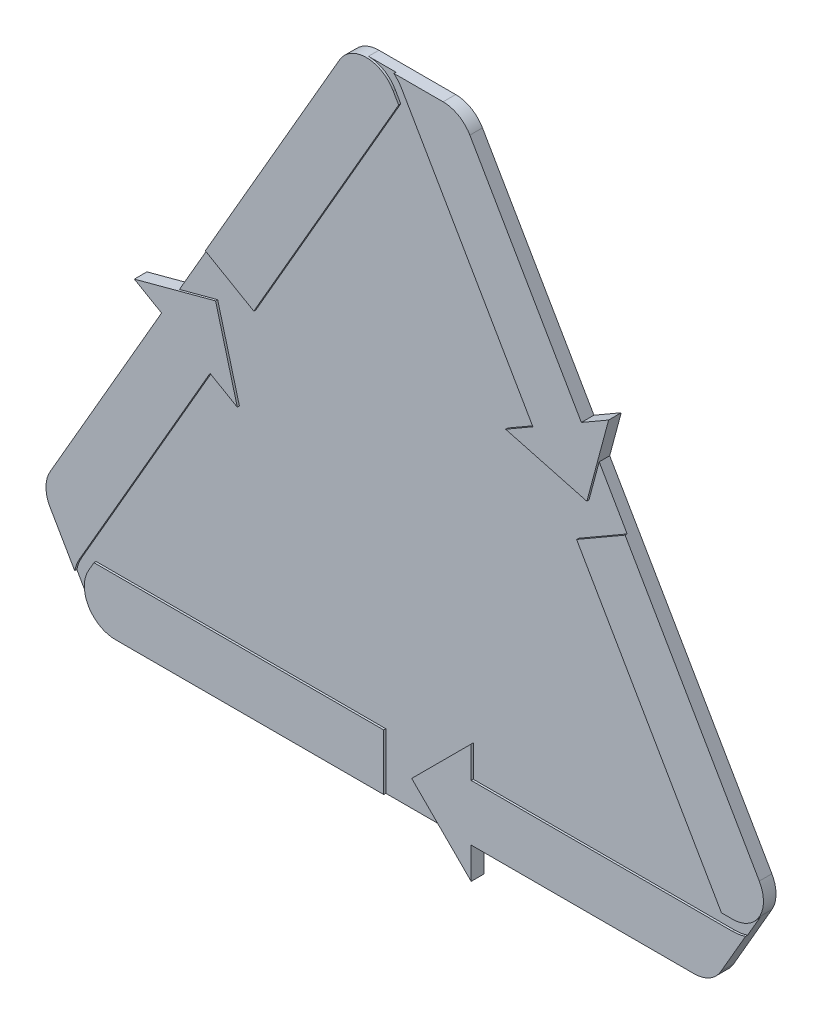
from build123d import *

# Parameters (mm, degrees)
BOSS_EXTRUDE1_DEPTH   = 0.3
BOSS_EXTRUDE1_2_DEPTH = 0.3
CIRPATTERN1_COUNT     = 3
BOSS_EXTRUDE3_START   = -1.5
BOSS_EXTRUDE3_DEPTH   = 1.5
BOSS_EXTRUDE4_DEPTH   = 1.5


with BuildPart() as part:
    # Sketch1 → Boss-Extrude1 (new body)
    with BuildSketch(Plane.XY):
        with BuildLine():
            Line((31.5, 14.722431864), (24.57179677, 10.722431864))
            Line((24.57179677, 10.722431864), (45.277568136, -25.141016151))
            Line((45.277568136, -25.141016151), (46.854227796, -25.141016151))
            ThreePointArc((46.854227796, -25.141016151), (50.684700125, -22.929491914), (50.684700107, -18.506443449))
            Line((50.684700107, -18.506443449), (31.5, 14.722431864))
        make_face()
    extrude(amount=BOSS_EXTRUDE1_DEPTH)


with BuildPart() as body_2:
    # Sketch1 → Boss-Extrude1 2 (new body)
    with BuildSketch(Plane.XY):
        with BuildLine():
            Line((9.5, -22.141016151), (1, -30.641016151))
            Line((1, -30.641016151), (9.5, -39.141016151))
            Line((9.5, -39.141016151), (9.5, -34.641016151))
            Line((9.5, -34.641016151), (41.369400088, -34.641016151))
            ThreePointArc((41.369400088, -34.641016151), (43.580924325, -34.048440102), (45.199872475, -32.429492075))
            Line((45.199872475, -32.429492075), (48.714982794, -26.341142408))
            ThreePointArc((48.714982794, -26.341142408), (47.796609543, -26.565567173), (46.854227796, -26.641016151))
            Line((46.854227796, -26.641016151), (9.5, -26.641016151))
            Line((9.5, -26.641016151), (9.5, -22.141016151))
        make_face()
    extrude(amount=BOSS_EXTRUDE1_2_DEPTH)


with BuildPart() as cirpattern1_1:
    # CirPattern1: pattern copy
    add(part.part.rotate(Axis((0, 0, 0), (0, 0, 1)), 1 * 360 / CIRPATTERN1_COUNT))


with BuildPart() as cirpattern1_2:
    # CirPattern1: pattern copy
    add(part.part.rotate(Axis((0, 0, 0), (0, 0, 1)), 2 * 360 / CIRPATTERN1_COUNT))


with BuildPart() as cirpattern1_3:
    # CirPattern1: pattern copy
    add(body_2.part.rotate(Axis((0, 0, 0), (0, 0, 1)), 1 * 360 / CIRPATTERN1_COUNT))


with BuildPart() as cirpattern1_4:
    # CirPattern1: pattern copy
    add(body_2.part.rotate(Axis((0, 0, 0), (0, 0, 1)), 2 * 360 / CIRPATTERN1_COUNT))


with BuildPart() as part_1:
    add(part.part)

    add(body_2.part)  # Boss-Extrude3 merges body 2

    add(cirpattern1_1.part)  # Boss-Extrude3 merges CirPattern1_1

    add(cirpattern1_2.part)  # Boss-Extrude3 merges CirPattern1_2

    add(cirpattern1_3.part)  # Boss-Extrude3 merges CirPattern1_3

    add(cirpattern1_4.part)  # Boss-Extrude3 merges CirPattern1_4
    # Sketch3 → Boss-Extrude3 (add)
    with BuildSketch(Plane.XY.offset(BOSS_EXTRUDE3_START)):
        with BuildLine():
            Line((45.199872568, -32.429491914), (50.684700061, -22.929492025))
            ThreePointArc((50.684700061, -22.929492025), (51.27727625, -20.717967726), (50.684700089, -18.506443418))
            Line((50.684700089, -18.506443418), (9.315299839, 53.147459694))
            ThreePointArc((9.315299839, 53.147459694), (7.696351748, 54.766407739), (5.484827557, 55.358983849))
            Line((5.484827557, 55.358983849), (-5.484827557, 55.358983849))
            ThreePointArc((-5.484827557, 55.358983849), (-7.696351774, 54.766407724), (-9.315299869, 53.147459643))
            Line((-9.315299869, 53.147459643), (-50.684700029, -18.506443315))
            ThreePointArc((-50.684700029, -18.506443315), (-51.27727625, -20.717968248), (-50.684699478, -22.929493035))
            Line((-50.684699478, -22.929493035), (-45.199871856, -32.429493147))
            ThreePointArc((-45.199871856, -32.429493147), (-43.580923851, -34.048440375), (-41.369400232, -34.641016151))
            Line((-41.369400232, -34.641016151), (41.369400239, -34.641016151))
            ThreePointArc((41.369400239, -34.641016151), (43.580924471, -34.048440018), (45.199872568, -32.429491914))
        make_face()
    extrude(amount=BOSS_EXTRUDE3_DEPTH)

    # Sketch4 → Boss-Extrude4 (add, through all)
    with BuildSketch(Plane.XY):
        with BuildLine():
            Line((1, -30.641016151), (9.5, -39.141016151))
            Line((9.5, -39.141016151), (9.5, -34.641016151))
            Line((9.5, -34.641016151), (41.369400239, -34.641016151))
            ThreePointArc((41.369400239, -34.641016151), (43.580924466, -34.048440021), (45.199872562, -32.429491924))
            Line((45.199872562, -32.429491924), (48.714982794, -26.341142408))
            ThreePointArc((48.714982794, -26.341142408), (47.796609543, -26.565567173), (46.854227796, -26.641016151))
            Line((46.854227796, -26.641016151), (9.5, -26.641016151))
            Line((9.5, -26.641016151), (9.5, -22.141016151))
            Line((9.5, -22.141016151), (1, -30.641016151))
        make_face()
        with BuildLine():
            Line((26.035898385, 16.186533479), (29.147114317, 27.797749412))
            Line((29.147114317, 27.797749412), (25.25, 25.547749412))
            Line((25.25, 25.547749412), (9.315299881, 53.147459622))
            ThreePointArc((9.315299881, 53.147459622), (7.696351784, 54.766407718), (5.484827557, 55.358983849))
            Line((5.484827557, 55.358983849), (-1.545392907, 55.358983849))
            ThreePointArc((-1.545392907, 55.358983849), (-0.891848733, 54.675861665), (-0.355317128, 53.897459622))
            Line((-0.355317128, 53.897459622), (18.32179677, 21.547749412))
            Line((18.32179677, 21.547749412), (14.424682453, 19.297749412))
            Line((14.424682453, 19.297749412), (26.035898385, 16.186533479))
        make_face()
        with BuildLine():
            Line((-27.035898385, 14.454482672), (-38.647114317, 11.34326674))
            Line((-38.647114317, 11.34326674), (-34.75, 9.09326674))
            Line((-34.75, 9.09326674), (-50.684700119, -18.50644347))
            ThreePointArc((-50.684700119, -18.50644347), (-51.27727625, -20.717967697), (-50.684700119, -22.929491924))
            Line((-50.684700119, -22.929491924), (-47.169589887, -29.017841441))
            ThreePointArc((-47.169589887, -29.017841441), (-46.904760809, -28.110294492), (-46.498910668, -27.25644347))
            Line((-46.498910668, -27.25644347), (-27.82179677, 5.09326674))
            Line((-27.82179677, 5.09326674), (-23.924682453, 2.84326674))
            Line((-23.924682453, 2.84326674), (-27.035898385, 14.454482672))
        make_face()
    extrude(amount=-BOSS_EXTRUDE4_DEPTH)


solid = part_1.part
